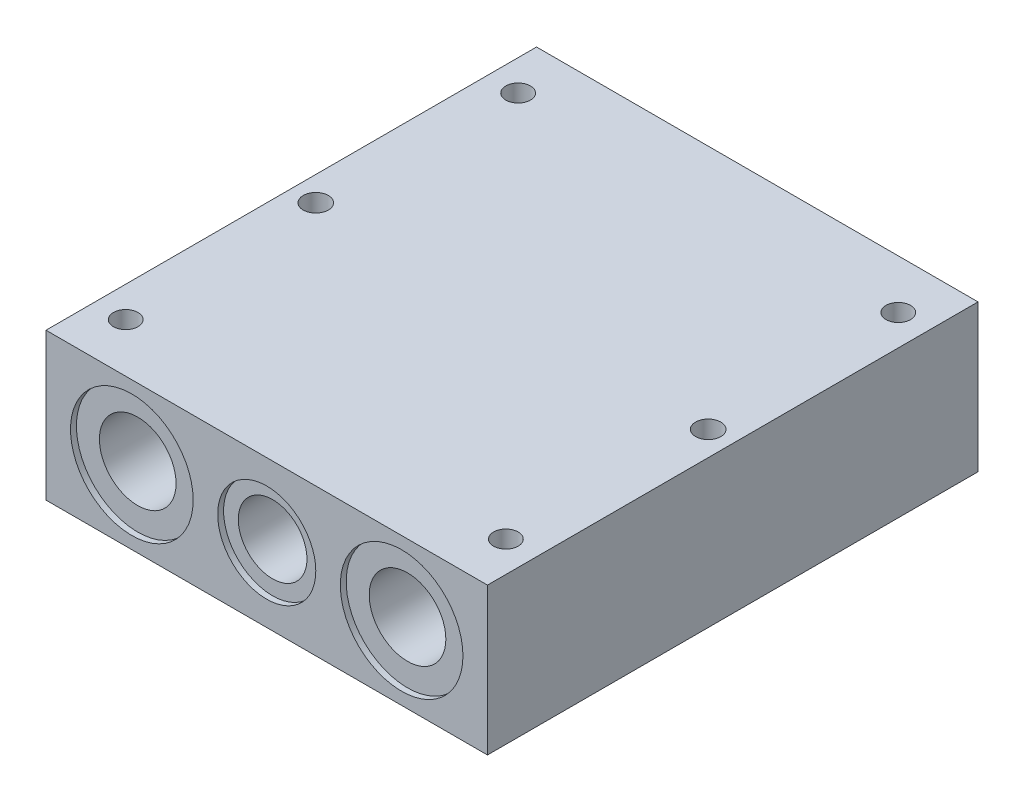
from build123d import *

# Parameters (mm, degrees)
SKETCH1_W                        = 114.3
SKETCH1_H                        = 127
EXTRUDE1_DEPTH                   = 19.05
SKETCH2_R                        = 9.921875
CUT_EXTRUDE1_DEPTH               = 141.563241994
SKETCH3_R                        = 15.875
CUT_EXTRUDE2_DEPTH               = 1.524
CUT_EXTRUDE3_START               = -1.524
SKETCH4_R                        = 15.875
CUT_EXTRUDE3_DEPTH               = 1.524
SKETCH5_R                        = 8.89
CUT_EXTRUDE4_DEPTH               = 141.563241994
SKETCH6_R                        = 12.7
CUT_EXTRUDE5_DEPTH               = 1.524
CUT_EXTRUDE6_START               = -1.524
SKETCH7_R                        = 12.7
CUT_EXTRUDE6_DEPTH               = 1.524
F_5_16_18_MOUNTING_HOLES_D       = 6.5278
F_1_4_DOWEL_HOLES_SLIP_FIT_D     = 6.3754
F_1_4_DOWEL_HOLES_SLIP_FIT_DEPTH = 6.35


with BuildPart() as part:
    # Sketch1 → Extrude1 (new, symmetric)
    with BuildSketch(Plane(origin=(0, 0, 0), x_dir=(1, 0, 0), z_dir=(0, 1, 0))):
        Rectangle(SKETCH1_W, SKETCH1_H)
    extrude(amount=EXTRUDE1_DEPTH, both=True)

    # Sketch2 → Cut-Extrude1 (cut, through all)
    with BuildSketch(Plane.XY.offset(63.5)):
        with Locations((34.925, 0)):
            Circle(SKETCH2_R)
        with Locations(Location((-34.925, 0, 0), (0, 0, 180))):
            Circle(SKETCH2_R)
    extrude(amount=-CUT_EXTRUDE1_DEPTH, mode=Mode.SUBTRACT)

    # Sketch3 → Cut-Extrude2 (cut)
    with BuildSketch(Plane.XY.offset(63.5)):
        with Locations((34.925, 0)):
            Circle(SKETCH3_R)
        with Locations((-34.925, 0)):
            Circle(SKETCH3_R)
    extrude(amount=-CUT_EXTRUDE2_DEPTH, mode=Mode.SUBTRACT)

    # Sketch4 → Cut-Extrude3 (cut)
    with BuildSketch(Plane(origin=(0, 0, -63.5), x_dir=(-1, 0, 0), z_dir=(0, 0, -1)).offset(CUT_EXTRUDE3_START)):
        with Locations(Location((34.925, 0, 0), (0, 0, 180))):
            Circle(SKETCH4_R)
        with Locations(Location((-34.925, 0, 0), (0, 0, 180))):
            Circle(SKETCH4_R)
    extrude(amount=CUT_EXTRUDE3_DEPTH, mode=Mode.SUBTRACT)

    # Sketch5 → Cut-Extrude4 (cut, through all)
    with BuildSketch(Plane.XY.offset(63.5)):
        Circle(SKETCH5_R)
    extrude(amount=-CUT_EXTRUDE4_DEPTH, mode=Mode.SUBTRACT)

    # Sketch6 → Cut-Extrude5 (cut)
    with BuildSketch(Plane.XY.offset(63.5)):
        Circle(SKETCH6_R)
    extrude(amount=-CUT_EXTRUDE5_DEPTH, mode=Mode.SUBTRACT)

    # Sketch7 → Cut-Extrude6 (cut)
    with BuildSketch(Plane(origin=(0, 0, -63.5), x_dir=(-1, 0, 0), z_dir=(0, 0, -1)).offset(CUT_EXTRUDE6_START)):
        with Locations(Location((0, 0, 0), (0, 0, 180))):
            Circle(SKETCH7_R)
    extrude(amount=CUT_EXTRUDE6_DEPTH, mode=Mode.SUBTRACT)

    # 5_16-18 _Mounting Holes (through all)
    with Locations(Plane(origin=(0, 19.05, 0), x_dir=(-1, 0, 0), z_dir=(0, 1, 0))):
        with Locations((50.8, 0), (-50.8, 0)):
            Hole(F_5_16_18_MOUNTING_HOLES_D / 2)

    # 1_4 Dowel Holes - Slip Fit
    with Locations(Plane(origin=(0, 19.05, 0), x_dir=(-1, 0, 0), z_dir=(0, 1, 0))):
        with Locations((49.2125, 50.8), (49.2125, -50.8), (-49.2125, -50.8), (-49.2125, 50.8)):
            Hole(F_1_4_DOWEL_HOLES_SLIP_FIT_D / 2, depth=F_1_4_DOWEL_HOLES_SLIP_FIT_DEPTH)


solid = part.part
